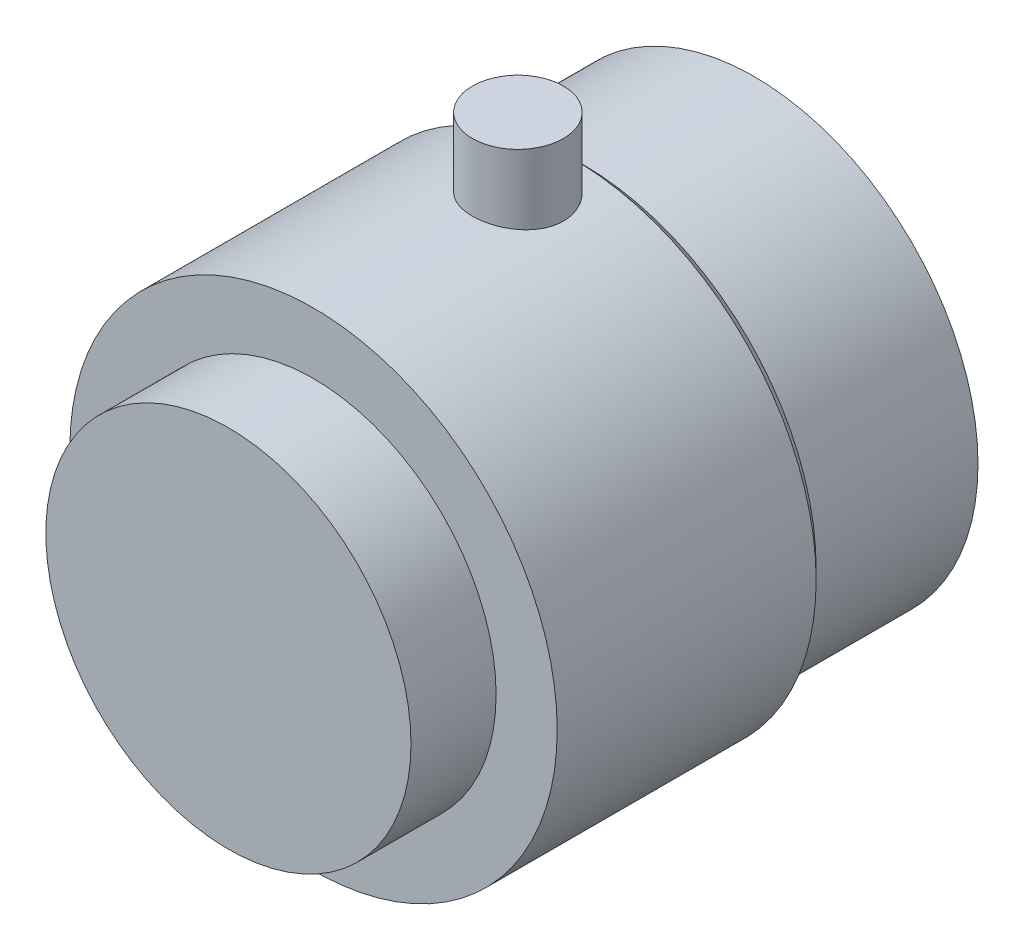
from build123d import *

# Parameters (mm, degrees)
SKETCH1_R      = 15.621
EXTRUDE1_DEPTH = 11.938
SKETCH2_R      = 17.018
EXTRUDE2_DEPTH = 18.8468
SKETCH3_R      = 12.7508
EXTRUDE3_DEPTH = 5.9436
SKETCH4_R      = 3.175
EXTRUDE4_DEPTH = 21.717
CHAMFER1_SIZE  = 0.762


with BuildPart() as part:
    # Sketch1 → Extrude1 (new body)
    with BuildSketch(Plane.XY):
        Circle(SKETCH1_R)
    extrude(amount=EXTRUDE1_DEPTH)

    # Sketch2 → Extrude2 (add)
    with BuildSketch(Plane.XY.offset(11.938)):
        Circle(SKETCH2_R)
    extrude(amount=EXTRUDE2_DEPTH)

    # Sketch3 → Extrude3 (add)
    with BuildSketch(Plane.XY.offset(30.7848)):
        Circle(SKETCH3_R)
    extrude(amount=EXTRUDE3_DEPTH)

    # Sketch4 → Extrude4 (add)
    with BuildSketch(Plane(origin=(0, 0, 0), x_dir=(1, 0, 0), z_dir=(0, 1, 0))):
        with Locations(Location((0, -16.51, 0), (0, 0, 90))):
            Circle(SKETCH4_R)
    extrude(amount=EXTRUDE4_DEPTH)

    # Chamfer1
    chamfer1_edges = [part.edges().sort_by_distance(p)[0] for p in [
        (-17.018, 0, 11.938),
    ]]
    chamfer(chamfer1_edges, length=CHAMFER1_SIZE)


solid = part.part
